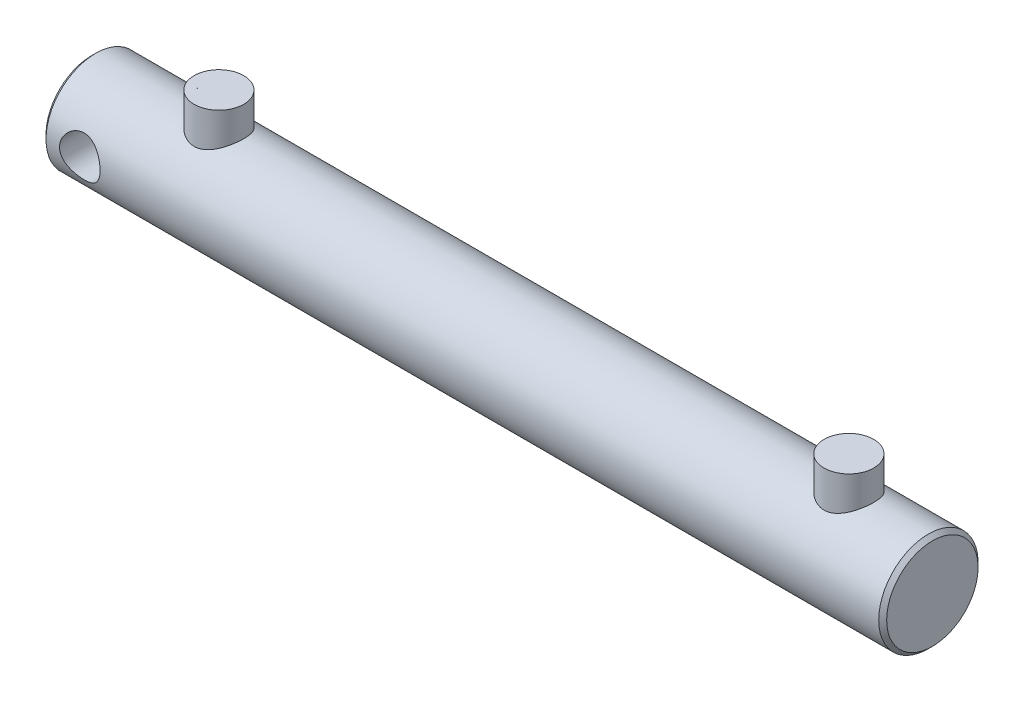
from build123d import *

# Parameters (mm, degrees)
ESQUISSE1_W                  = 423
ESQUISSE1_H                  = 25
CHANFREIN1_SIZE              = 2
ENL_V_MAT_EXTRU_1_DEPTH      = 215.434722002
ENL_V_MAT_EXTRU_1_DEPTH_BACK = 215.434722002
ESQUISSE3_R                  = 10.2
ESQUISSE5_R                  = 12.5
EXTRUSION2_DEPTH             = 40


with BuildPart() as part:
    # Esquisse1 → R_volution1 (revolve)
    with BuildSketch(Plane.XY, mode=Mode.PRIVATE) as r_volution1_sk:
        with Locations((0, 12.5)):
            Rectangle(ESQUISSE1_W, ESQUISSE1_H)
    revolve(r_volution1_sk.sketch.rotate(Axis((-211.5, 0, 0), (1, 0, 0)), 90), axis=Axis((-211.5, 0, 0), (1, 0, 0)))

    # Chanfrein1
    chanfrein1_edges = [part.edges().sort_by_distance(p)[0] for p in [
        (211.5, 0, -25),
        (-211.5, 0, -25),
    ]]
    chamfer(chanfrein1_edges, length=CHANFREIN1_SIZE)

    # Esquisse3 → Enl_v. mat.-Extru.1 (cut, two sides: drawn at the far end of the back side and taken through both)
    with BuildSketch(Plane.XY.offset(-ENL_V_MAT_EXTRU_1_DEPTH_BACK)):
        with Locations((-192.5, 0)):
            Circle(ESQUISSE3_R)
    extrude(amount=ENL_V_MAT_EXTRU_1_DEPTH + ENL_V_MAT_EXTRU_1_DEPTH_BACK, mode=Mode.SUBTRACT)

    # Esquisse5 → Extrusion2 (add)
    with BuildSketch(Plane(origin=(0, 0, 0), x_dir=(1, 0, 0), z_dir=(0, 1, 0))):
        with Locations(Location((-147.5, 0, 0), (0, 0, 90))):
            Circle(ESQUISSE5_R)
        with Locations(Location((169.5, 0, 0), (0, 0, 90))):
            Circle(ESQUISSE5_R)
    extrude(amount=EXTRUSION2_DEPTH)


solid = part.part
